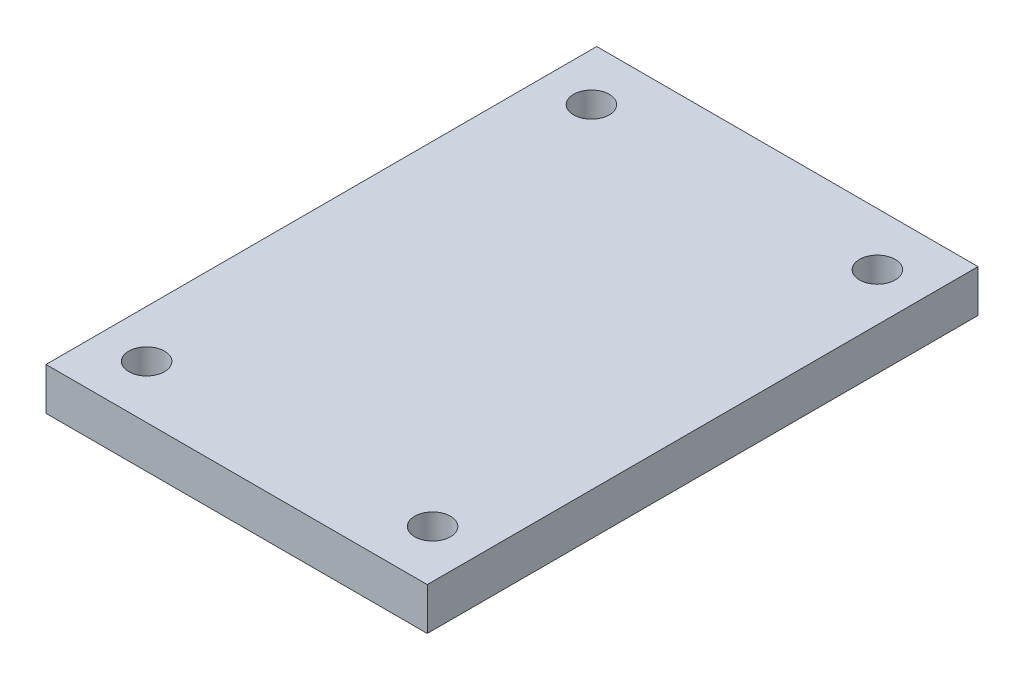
ISO-10303-21;
HEADER;
FILE_DESCRIPTION(('STEP AP214'),'2;1');
FILE_NAME('part.step','',(''),(''),'','','');
FILE_SCHEMA(('AUTOMOTIVE_DESIGN { 1 0 10303 214 1 1 1 1 }'));
ENDSEC;
DATA;
#1=APPLICATION_CONTEXT('core data for automotive mechanical design processes');
#2=APPLICATION_PROTOCOL_DEFINITION('international standard','automotive_design',2000,#1);
#3=PRODUCT_CONTEXT('',#1,'mechanical');
#4=PRODUCT('Part','Part','',(#3));
#5=PRODUCT_RELATED_PRODUCT_CATEGORY('part','',(#4));
#6=PRODUCT_DEFINITION_FORMATION('','',#4);
#7=PRODUCT_DEFINITION_CONTEXT('part definition',#1,'design');
#8=PRODUCT_DEFINITION('design','',#6,#7);
#9=PRODUCT_DEFINITION_SHAPE('','',#8);
#10=(LENGTH_UNIT() NAMED_UNIT(*) SI_UNIT(.MILLI.,.METRE.));
#11=(NAMED_UNIT(*) PLANE_ANGLE_UNIT() SI_UNIT($,.RADIAN.));
#12=(NAMED_UNIT(*) SI_UNIT($,.STERADIAN.) SOLID_ANGLE_UNIT());
#13=UNCERTAINTY_MEASURE_WITH_UNIT(LENGTH_MEASURE(1.E-05),#10,'distance_accuracy_value','');
#14=(GEOMETRIC_REPRESENTATION_CONTEXT(3) GLOBAL_UNCERTAINTY_ASSIGNED_CONTEXT((#13)) GLOBAL_UNIT_ASSIGNED_CONTEXT((#10,
#11,#12)) REPRESENTATION_CONTEXT('',''));
#15=CARTESIAN_POINT('',(0.,0.,0.));
#16=DIRECTION('',(0.,0.,1.));
#17=DIRECTION('',(1.,0.,0.));
#18=AXIS2_PLACEMENT_3D('',#15,#16,#17);
#19=CARTESIAN_POINT('',(57.15,12.7,-82.55));
#20=DIRECTION('',(-1.,0.,0.));
#21=DIRECTION('',(0.,0.,1.));
#22=AXIS2_PLACEMENT_3D('',#19,#20,#21);
#23=PLANE('',#22);
#24=DIRECTION('',(0.,0.,-1.));
#25=VECTOR('',#24,1.);
#26=CARTESIAN_POINT('',(57.15,0.,-82.55));
#27=LINE('',#26,#25);
#28=CARTESIAN_POINT('',(57.15,0.,82.55));
#29=VERTEX_POINT('',#28);
#30=CARTESIAN_POINT('',(57.15,0.,-82.55));
#31=VERTEX_POINT('',#30);
#32=EDGE_CURVE('E98',#29,#31,#27,.T.);
#33=ORIENTED_EDGE('',*,*,#32,.T.);
#34=DIRECTION('',(0.,-1.,0.));
#35=VECTOR('',#34,1.);
#36=CARTESIAN_POINT('',(57.15,12.7,-82.55));
#37=LINE('',#36,#35);
#38=CARTESIAN_POINT('',(57.15,12.7,-82.55));
#39=VERTEX_POINT('',#38);
#40=EDGE_CURVE('E11',#39,#31,#37,.T.);
#41=ORIENTED_EDGE('',*,*,#40,.F.);
#42=DIRECTION('',(0.,0.,-1.));
#43=VECTOR('',#42,1.);
#44=CARTESIAN_POINT('',(57.15,12.7,-82.55));
#45=LINE('',#44,#43);
#46=CARTESIAN_POINT('',(57.15,12.7,82.55));
#47=VERTEX_POINT('',#46);
#48=EDGE_CURVE('E86',#47,#39,#45,.T.);
#49=ORIENTED_EDGE('',*,*,#48,.F.);
#50=DIRECTION('',(0.,-1.,0.));
#51=VECTOR('',#50,1.);
#52=CARTESIAN_POINT('',(57.15,12.7,82.55));
#53=LINE('',#52,#51);
#54=EDGE_CURVE('E94',#47,#29,#53,.T.);
#55=ORIENTED_EDGE('',*,*,#54,.T.);
#56=EDGE_LOOP('',(#33,#41,#49,#55));
#57=FACE_BOUND('',#56,.T.);
#58=ADVANCED_FACE('F35',(#57),#23,.F.);
#59=CARTESIAN_POINT('',(-57.15,12.7,-82.55));
#60=DIRECTION('',(0.,0.,1.));
#61=DIRECTION('',(1.,0.,0.));
#62=AXIS2_PLACEMENT_3D('',#59,#60,#61);
#63=PLANE('',#62);
#64=DIRECTION('',(-1.,0.,0.));
#65=VECTOR('',#64,1.);
#66=CARTESIAN_POINT('',(-57.15,0.,-82.55));
#67=LINE('',#66,#65);
#68=CARTESIAN_POINT('',(-57.15,0.,-82.55));
#69=VERTEX_POINT('',#68);
#70=EDGE_CURVE('E90',#31,#69,#67,.T.);
#71=ORIENTED_EDGE('',*,*,#70,.T.);
#72=DIRECTION('',(0.,-1.,0.));
#73=VECTOR('',#72,1.);
#74=CARTESIAN_POINT('',(-57.15,12.7,-82.55));
#75=LINE('',#74,#73);
#76=CARTESIAN_POINT('',(-57.15,12.7,-82.55));
#77=VERTEX_POINT('',#76);
#78=EDGE_CURVE('E43',#77,#69,#75,.T.);
#79=ORIENTED_EDGE('',*,*,#78,.F.);
#80=DIRECTION('',(-1.,0.,0.));
#81=VECTOR('',#80,1.);
#82=CARTESIAN_POINT('',(-57.15,12.7,-82.55));
#83=LINE('',#82,#81);
#84=EDGE_CURVE('E81',#39,#77,#83,.T.);
#85=ORIENTED_EDGE('',*,*,#84,.F.);
#86=ORIENTED_EDGE('',*,*,#40,.T.);
#87=EDGE_LOOP('',(#71,#79,#85,#86));
#88=FACE_BOUND('',#87,.T.);
#89=ADVANCED_FACE('F89',(#88),#63,.F.);
#90=CARTESIAN_POINT('',(-57.15,12.7,-82.55));
#91=DIRECTION('',(1.,0.,0.));
#92=DIRECTION('',(0.,0.,-1.));
#93=AXIS2_PLACEMENT_3D('',#90,#91,#92);
#94=PLANE('',#93);
#95=DIRECTION('',(0.,0.,1.));
#96=VECTOR('',#95,1.);
#97=CARTESIAN_POINT('',(-57.15,0.,-82.55));
#98=LINE('',#97,#96);
#99=CARTESIAN_POINT('',(-57.15,0.,82.55));
#100=VERTEX_POINT('',#99);
#101=EDGE_CURVE('E68',#69,#100,#98,.T.);
#102=ORIENTED_EDGE('',*,*,#101,.T.);
#103=DIRECTION('',(0.,-1.,0.));
#104=VECTOR('',#103,1.);
#105=CARTESIAN_POINT('',(-57.15,12.7,82.55));
#106=LINE('',#105,#104);
#107=CARTESIAN_POINT('',(-57.15,12.7,82.55));
#108=VERTEX_POINT('',#107);
#109=EDGE_CURVE('E91',#108,#100,#106,.T.);
#110=ORIENTED_EDGE('',*,*,#109,.F.);
#111=DIRECTION('',(0.,0.,1.));
#112=VECTOR('',#111,1.);
#113=CARTESIAN_POINT('',(-57.15,12.7,-82.55));
#114=LINE('',#113,#112);
#115=EDGE_CURVE('E84',#77,#108,#114,.T.);
#116=ORIENTED_EDGE('',*,*,#115,.F.);
#117=ORIENTED_EDGE('',*,*,#78,.T.);
#118=EDGE_LOOP('',(#102,#110,#116,#117));
#119=FACE_BOUND('',#118,.T.);
#120=ADVANCED_FACE('F92',(#119),#94,.F.);
#121=CARTESIAN_POINT('',(-57.15,12.7,82.55));
#122=DIRECTION('',(0.,0.,-1.));
#123=DIRECTION('',(-1.,0.,0.));
#124=AXIS2_PLACEMENT_3D('',#121,#122,#123);
#125=PLANE('',#124);
#126=DIRECTION('',(1.,0.,0.));
#127=VECTOR('',#126,1.);
#128=CARTESIAN_POINT('',(-57.15,0.,82.55));
#129=LINE('',#128,#127);
#130=EDGE_CURVE('E74',#100,#29,#129,.T.);
#131=ORIENTED_EDGE('',*,*,#130,.T.);
#132=ORIENTED_EDGE('',*,*,#54,.F.);
#133=DIRECTION('',(1.,0.,0.));
#134=VECTOR('',#133,1.);
#135=CARTESIAN_POINT('',(-57.15,12.7,82.55));
#136=LINE('',#135,#134);
#137=EDGE_CURVE('E51',#108,#47,#136,.T.);
#138=ORIENTED_EDGE('',*,*,#137,.F.);
#139=ORIENTED_EDGE('',*,*,#109,.T.);
#140=EDGE_LOOP('',(#131,#132,#138,#139));
#141=FACE_BOUND('',#140,.T.);
#142=ADVANCED_FACE('F106',(#141),#125,.F.);
#143=CARTESIAN_POINT('',(0.,12.7,0.));
#144=DIRECTION('',(0.,1.,0.));
#145=DIRECTION('',(0.,0.,1.));
#146=AXIS2_PLACEMENT_3D('',#143,#144,#145);
#147=PLANE('',#146);
#148=CARTESIAN_POINT('',(-42.8625,12.7,-66.675));
#149=DIRECTION('',(0.,1.,0.));
#150=DIRECTION('',(0.,0.,1.));
#151=AXIS2_PLACEMENT_3D('',#148,#149,#150);
#152=CIRCLE('',#151,5.35812999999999);
#153=CARTESIAN_POINT('',(-42.8625,12.7,-61.31687));
#154=VERTEX_POINT('',#153);
#155=EDGE_CURVE('E132',#154,#154,#152,.T.);
#156=ORIENTED_EDGE('',*,*,#155,.F.);
#157=EDGE_LOOP('',(#156));
#158=FACE_BOUND('',#157,.T.);
#159=CARTESIAN_POINT('',(42.8625,12.7,-66.675));
#160=DIRECTION('',(0.,1.,0.));
#161=DIRECTION('',(0.,0.,1.));
#162=AXIS2_PLACEMENT_3D('',#159,#160,#161);
#163=CIRCLE('',#162,5.35812999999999);
#164=CARTESIAN_POINT('',(42.8625,12.7,-61.31687));
#165=VERTEX_POINT('',#164);
#166=EDGE_CURVE('E126',#165,#165,#163,.T.);
#167=ORIENTED_EDGE('',*,*,#166,.F.);
#168=EDGE_LOOP('',(#167));
#169=FACE_BOUND('',#168,.T.);
#170=CARTESIAN_POINT('',(42.8625,12.7,66.675));
#171=DIRECTION('',(0.,1.,0.));
#172=DIRECTION('',(0.,0.,1.));
#173=AXIS2_PLACEMENT_3D('',#170,#171,#172);
#174=CIRCLE('',#173,5.35812999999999);
#175=CARTESIAN_POINT('',(42.8625,12.7,72.03313));
#176=VERTEX_POINT('',#175);
#177=EDGE_CURVE('E120',#176,#176,#174,.T.);
#178=ORIENTED_EDGE('',*,*,#177,.F.);
#179=EDGE_LOOP('',(#178));
#180=FACE_BOUND('',#179,.T.);
#181=CARTESIAN_POINT('',(-42.8625,12.7,66.675));
#182=DIRECTION('',(0.,1.,0.));
#183=DIRECTION('',(0.,0.,1.));
#184=AXIS2_PLACEMENT_3D('',#181,#182,#183);
#185=CIRCLE('',#184,5.35812999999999);
#186=CARTESIAN_POINT('',(-42.8625,12.7,72.03313));
#187=VERTEX_POINT('',#186);
#188=EDGE_CURVE('E114',#187,#187,#185,.T.);
#189=ORIENTED_EDGE('',*,*,#188,.F.);
#190=EDGE_LOOP('',(#189));
#191=FACE_BOUND('',#190,.T.);
#192=ORIENTED_EDGE('',*,*,#48,.T.);
#193=ORIENTED_EDGE('',*,*,#84,.T.);
#194=ORIENTED_EDGE('',*,*,#115,.T.);
#195=ORIENTED_EDGE('',*,*,#137,.T.);
#196=EDGE_LOOP('',(#192,#193,#194,#195));
#197=FACE_BOUND('',#196,.T.);
#198=ADVANCED_FACE('F82',(#158,#169,#180,#191,#197),#147,.T.);
#199=CARTESIAN_POINT('',(0.,0.,0.));
#200=DIRECTION('',(0.,1.,0.));
#201=DIRECTION('',(0.,0.,1.));
#202=AXIS2_PLACEMENT_3D('',#199,#200,#201);
#203=PLANE('',#202);
#204=CARTESIAN_POINT('',(-42.8625,0.,-66.675));
#205=DIRECTION('',(0.,1.,0.));
#206=DIRECTION('',(0.,0.,1.));
#207=AXIS2_PLACEMENT_3D('',#204,#205,#206);
#208=CIRCLE('',#207,5.35813);
#209=CARTESIAN_POINT('',(-42.8625,0.,-61.31687));
#210=VERTEX_POINT('',#209);
#211=EDGE_CURVE('E129',#210,#210,#208,.T.);
#212=ORIENTED_EDGE('',*,*,#211,.T.);
#213=EDGE_LOOP('',(#212));
#214=FACE_BOUND('',#213,.T.);
#215=CARTESIAN_POINT('',(42.8625,0.,-66.675));
#216=DIRECTION('',(0.,1.,0.));
#217=DIRECTION('',(0.,0.,1.));
#218=AXIS2_PLACEMENT_3D('',#215,#216,#217);
#219=CIRCLE('',#218,5.35813);
#220=CARTESIAN_POINT('',(42.8625,0.,-61.31687));
#221=VERTEX_POINT('',#220);
#222=EDGE_CURVE('E123',#221,#221,#219,.T.);
#223=ORIENTED_EDGE('',*,*,#222,.T.);
#224=EDGE_LOOP('',(#223));
#225=FACE_BOUND('',#224,.T.);
#226=CARTESIAN_POINT('',(42.8625,0.,66.675));
#227=DIRECTION('',(0.,1.,0.));
#228=DIRECTION('',(0.,0.,1.));
#229=AXIS2_PLACEMENT_3D('',#226,#227,#228);
#230=CIRCLE('',#229,5.35813);
#231=CARTESIAN_POINT('',(42.8625,0.,72.03313));
#232=VERTEX_POINT('',#231);
#233=EDGE_CURVE('E117',#232,#232,#230,.T.);
#234=ORIENTED_EDGE('',*,*,#233,.T.);
#235=EDGE_LOOP('',(#234));
#236=FACE_BOUND('',#235,.T.);
#237=CARTESIAN_POINT('',(-42.8625,0.,66.675));
#238=DIRECTION('',(0.,1.,0.));
#239=DIRECTION('',(0.,0.,1.));
#240=AXIS2_PLACEMENT_3D('',#237,#238,#239);
#241=CIRCLE('',#240,5.35813);
#242=CARTESIAN_POINT('',(-42.8625,0.,72.03313));
#243=VERTEX_POINT('',#242);
#244=EDGE_CURVE('E101',#243,#243,#241,.T.);
#245=ORIENTED_EDGE('',*,*,#244,.T.);
#246=EDGE_LOOP('',(#245));
#247=FACE_BOUND('',#246,.T.);
#248=ORIENTED_EDGE('',*,*,#32,.F.);
#249=ORIENTED_EDGE('',*,*,#130,.F.);
#250=ORIENTED_EDGE('',*,*,#101,.F.);
#251=ORIENTED_EDGE('',*,*,#70,.F.);
#252=EDGE_LOOP('',(#248,#249,#250,#251));
#253=FACE_BOUND('',#252,.T.);
#254=ADVANCED_FACE('F109',(#214,#225,#236,#247,#253),#203,.F.);
#255=CARTESIAN_POINT('',(-42.8625,12.7,66.675));
#256=DIRECTION('',(0.,1.,0.));
#257=DIRECTION('',(0.,0.,1.));
#258=AXIS2_PLACEMENT_3D('',#255,#256,#257);
#259=CYLINDRICAL_SURFACE('',#258,5.35812999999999);
#260=ORIENTED_EDGE('',*,*,#244,.F.);
#261=EDGE_LOOP('',(#260));
#262=FACE_BOUND('',#261,.T.);
#263=ORIENTED_EDGE('',*,*,#188,.T.);
#264=EDGE_LOOP('',(#263));
#265=FACE_BOUND('',#264,.T.);
#266=ADVANCED_FACE('F147',(#262,#265),#259,.F.);
#267=CARTESIAN_POINT('',(42.8625,12.7,66.675));
#268=DIRECTION('',(0.,1.,0.));
#269=DIRECTION('',(0.,0.,1.));
#270=AXIS2_PLACEMENT_3D('',#267,#268,#269);
#271=CYLINDRICAL_SURFACE('',#270,5.35812999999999);
#272=ORIENTED_EDGE('',*,*,#233,.F.);
#273=EDGE_LOOP('',(#272));
#274=FACE_BOUND('',#273,.T.);
#275=ORIENTED_EDGE('',*,*,#177,.T.);
#276=EDGE_LOOP('',(#275));
#277=FACE_BOUND('',#276,.T.);
#278=ADVANCED_FACE('F149',(#274,#277),#271,.F.);
#279=CARTESIAN_POINT('',(42.8625,12.7,-66.675));
#280=DIRECTION('',(0.,1.,0.));
#281=DIRECTION('',(0.,0.,1.));
#282=AXIS2_PLACEMENT_3D('',#279,#280,#281);
#283=CYLINDRICAL_SURFACE('',#282,5.35812999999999);
#284=ORIENTED_EDGE('',*,*,#222,.F.);
#285=EDGE_LOOP('',(#284));
#286=FACE_BOUND('',#285,.T.);
#287=ORIENTED_EDGE('',*,*,#166,.T.);
#288=EDGE_LOOP('',(#287));
#289=FACE_BOUND('',#288,.T.);
#290=ADVANCED_FACE('F156',(#286,#289),#283,.F.);
#291=CARTESIAN_POINT('',(-42.8625,12.7,-66.675));
#292=DIRECTION('',(0.,1.,0.));
#293=DIRECTION('',(0.,0.,1.));
#294=AXIS2_PLACEMENT_3D('',#291,#292,#293);
#295=CYLINDRICAL_SURFACE('',#294,5.35812999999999);
#296=ORIENTED_EDGE('',*,*,#211,.F.);
#297=EDGE_LOOP('',(#296));
#298=FACE_BOUND('',#297,.T.);
#299=ORIENTED_EDGE('',*,*,#155,.T.);
#300=EDGE_LOOP('',(#299));
#301=FACE_BOUND('',#300,.T.);
#302=ADVANCED_FACE('F136',(#298,#301),#295,.F.);
#303=CLOSED_SHELL('',(#58,#89,#120,#142,#198,#254,#266,#278,#290,#302));
#304=MANIFOLD_SOLID_BREP('B2',#303);
#305=ADVANCED_BREP_SHAPE_REPRESENTATION('',(#18,#304),#14);
#306=SHAPE_DEFINITION_REPRESENTATION(#9,#305);
ENDSEC;
END-ISO-10303-21;
